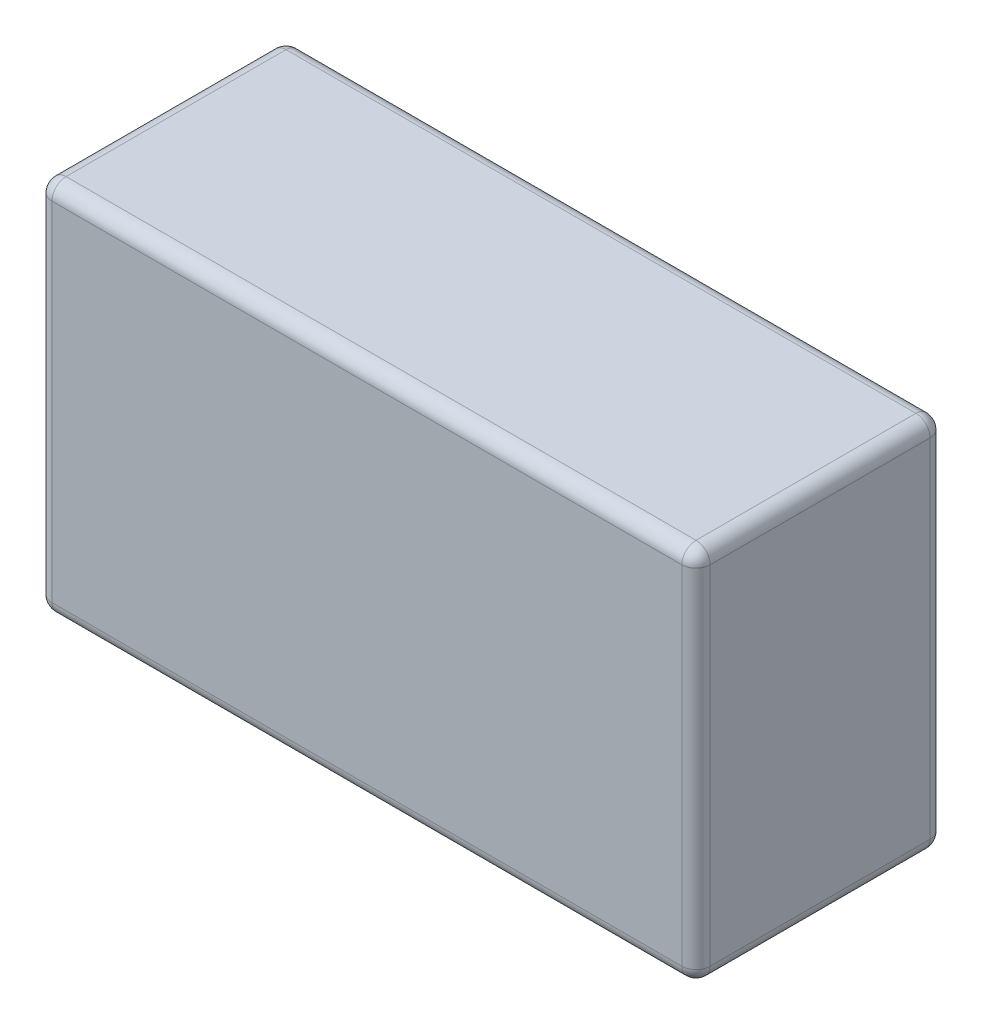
from build123d import *

# Parameters (mm, degrees)
SKETCH1_W           = 46.4
SKETCH1_H           = 26.5
BOSS_EXTRUDE2_DEPTH = 17.5
SKETCH2_R           = 3.5
BOSS_EXTRUDE3_DEPTH = 2
FILLET1_R           = 1


with BuildPart() as part:
    # Sketch1 → Boss-Extrude2 (new body)
    with BuildSketch(Plane.XY):
        with Locations((23.2, 13.25)):
            Rectangle(SKETCH1_W, SKETCH1_H)
    extrude(amount=BOSS_EXTRUDE2_DEPTH)

    # Sketch2 → Boss-Extrude3 (add)
    with BuildSketch(Plane.ZY):
        with Locations(Location((8.75, 20, 0), (0, 0, 180))):
            Circle(SKETCH2_R)
        Polygon((10.528885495, 3.520645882), (12.600891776, 6.990533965), (10.63188369, 10.519888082), (6.590869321, 10.579354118), (4.51886304, 7.109466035), (6.487871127, 3.580111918), align=None)
    extrude(amount=BOSS_EXTRUDE3_DEPTH)

    # Fillet1
    fillet1_edges = [part.edges().sort_by_distance(p)[0] for p in [
        (46.4, 13.25, 17.5),
        (23.2, 26.5, 17.5),
        (0, 13.25, 17.5),
        (23.2, 26.5, 0),
        (46.4, 13.25, 0),
        (23.2, 0, 0),
        (0, 13.25, 0),
        (0, 26.5, 8.75),
        (46.4, 26.5, 8.75),
        (46.4, 0, 8.75),
        (0, 0, 8.75),
        (23.2, 0, 17.5),
    ]]
    fillet(fillet1_edges, radius=FILLET1_R)


solid = part.part
